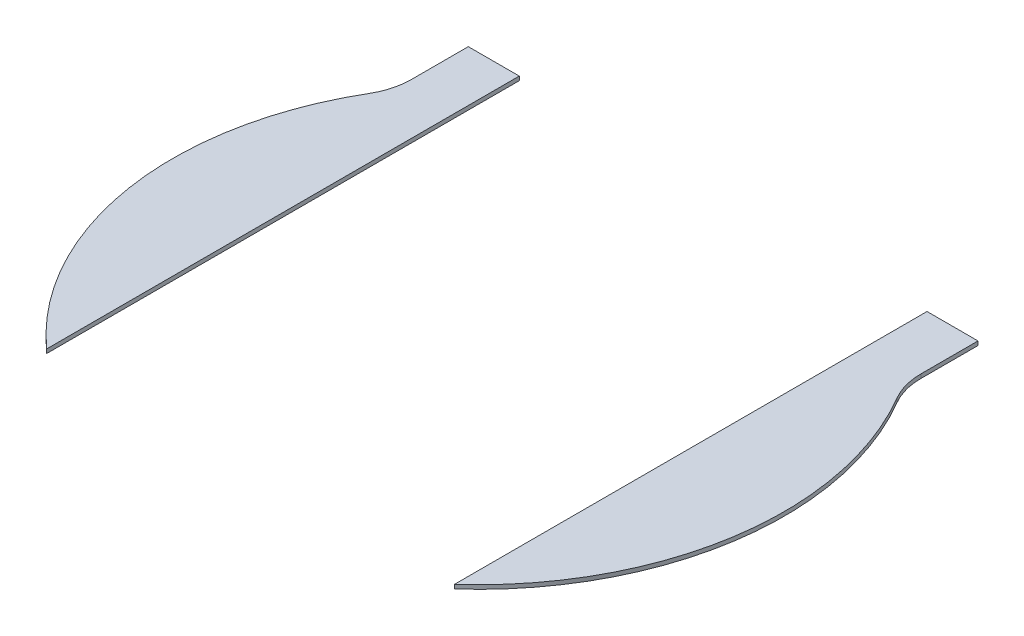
ISO-10303-21;
HEADER;
FILE_DESCRIPTION(('STEP AP214'),'2;1');
FILE_NAME('part.step','',(''),(''),'','','');
FILE_SCHEMA(('AUTOMOTIVE_DESIGN { 1 0 10303 214 1 1 1 1 }'));
ENDSEC;
DATA;
#1=APPLICATION_CONTEXT('core data for automotive mechanical design processes');
#2=APPLICATION_PROTOCOL_DEFINITION('international standard','automotive_design',2000,#1);
#3=PRODUCT_CONTEXT('',#1,'mechanical');
#4=PRODUCT('Part','Part','',(#3));
#5=PRODUCT_RELATED_PRODUCT_CATEGORY('part','',(#4));
#6=PRODUCT_DEFINITION_FORMATION('','',#4);
#7=PRODUCT_DEFINITION_CONTEXT('part definition',#1,'design');
#8=PRODUCT_DEFINITION('design','',#6,#7);
#9=PRODUCT_DEFINITION_SHAPE('','',#8);
#10=(LENGTH_UNIT() NAMED_UNIT(*) SI_UNIT(.MILLI.,.METRE.));
#11=(NAMED_UNIT(*) PLANE_ANGLE_UNIT() SI_UNIT($,.RADIAN.));
#12=(NAMED_UNIT(*) SI_UNIT($,.STERADIAN.) SOLID_ANGLE_UNIT());
#13=UNCERTAINTY_MEASURE_WITH_UNIT(LENGTH_MEASURE(1.E-05),#10,'distance_accuracy_value','');
#14=(GEOMETRIC_REPRESENTATION_CONTEXT(3) GLOBAL_UNCERTAINTY_ASSIGNED_CONTEXT((#13)) GLOBAL_UNIT_ASSIGNED_CONTEXT((#10,
#11,#12)) REPRESENTATION_CONTEXT('',''));
#15=CARTESIAN_POINT('',(0.,0.,0.));
#16=DIRECTION('',(0.,0.,1.));
#17=DIRECTION('',(1.,0.,0.));
#18=AXIS2_PLACEMENT_3D('',#15,#16,#17);
#19=CARTESIAN_POINT('',(3.98779999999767,0.05,-2.33831798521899));
#20=DIRECTION('',(0.,-1.,0.));
#21=DIRECTION('',(0.,0.,-1.));
#22=AXIS2_PLACEMENT_3D('',#19,#20,#21);
#23=CYLINDRICAL_SURFACE('',#22,0.812799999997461);
#24=CARTESIAN_POINT('',(3.98779999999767,0.,-2.33831798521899));
#25=DIRECTION('',(0.,1.,0.));
#26=DIRECTION('',(0.,0.,1.));
#27=AXIS2_PLACEMENT_3D('',#24,#25,#26);
#28=CIRCLE('',#27,0.812799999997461);
#29=CARTESIAN_POINT('',(3.17500000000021,0.,-2.33831798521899));
#30=VERTEX_POINT('',#29);
#31=CARTESIAN_POINT('',(3.28664835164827,0.,-1.92718515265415));
#32=VERTEX_POINT('',#31);
#33=EDGE_CURVE('E114',#30,#32,#28,.T.);
#34=ORIENTED_EDGE('',*,*,#33,.F.);
#35=DIRECTION('',(0.,-1.,0.));
#36=VECTOR('',#35,1.);
#37=CARTESIAN_POINT('',(3.17500000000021,0.05,-2.33831798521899));
#38=LINE('',#37,#36);
#39=CARTESIAN_POINT('',(3.17500000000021,0.05,-2.33831798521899));
#40=VERTEX_POINT('',#39);
#41=EDGE_CURVE('E12',#40,#30,#38,.T.);
#42=ORIENTED_EDGE('',*,*,#41,.F.);
#43=CARTESIAN_POINT('',(3.98779999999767,0.05,-2.33831798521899));
#44=DIRECTION('',(0.,1.,0.));
#45=DIRECTION('',(0.,0.,1.));
#46=AXIS2_PLACEMENT_3D('',#43,#44,#45);
#47=CIRCLE('',#46,0.812799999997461);
#48=CARTESIAN_POINT('',(3.28664835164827,0.05,-1.92718515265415));
#49=VERTEX_POINT('',#48);
#50=EDGE_CURVE('E124',#40,#49,#47,.T.);
#51=ORIENTED_EDGE('',*,*,#50,.T.);
#52=DIRECTION('',(0.,-1.,0.));
#53=VECTOR('',#52,1.);
#54=CARTESIAN_POINT('',(3.28664835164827,0.05,-1.92718515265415));
#55=LINE('',#54,#53);
#56=EDGE_CURVE('E81',#49,#32,#55,.T.);
#57=ORIENTED_EDGE('',*,*,#56,.T.);
#58=EDGE_LOOP('',(#34,#42,#51,#57));
#59=FACE_BOUND('',#58,.T.);
#60=ADVANCED_FACE('F40',(#59),#23,.F.);
#61=CARTESIAN_POINT('',(3.17500000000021,0.05,-0.104096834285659));
#62=DIRECTION('',(-1.,0.,0.));
#63=DIRECTION('',(0.,0.,1.));
#64=AXIS2_PLACEMENT_3D('',#61,#62,#63);
#65=PLANE('',#64);
#66=DIRECTION('',(0.,0.,-1.));
#67=VECTOR('',#66,1.);
#68=CARTESIAN_POINT('',(3.17500000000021,0.,-0.104096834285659));
#69=LINE('',#68,#67);
#70=CARTESIAN_POINT('',(3.17500000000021,0.,-3.04800000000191));
#71=VERTEX_POINT('',#70);
#72=EDGE_CURVE('E117',#30,#71,#69,.T.);
#73=ORIENTED_EDGE('',*,*,#72,.T.);
#74=DIRECTION('',(0.,-1.,0.));
#75=VECTOR('',#74,1.);
#76=CARTESIAN_POINT('',(3.17500000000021,0.05,-3.04800000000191));
#77=LINE('',#76,#75);
#78=CARTESIAN_POINT('',(3.17500000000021,0.05,-3.04800000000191));
#79=VERTEX_POINT('',#78);
#80=EDGE_CURVE('E48',#79,#71,#77,.T.);
#81=ORIENTED_EDGE('',*,*,#80,.F.);
#82=DIRECTION('',(0.,0.,-1.));
#83=VECTOR('',#82,1.);
#84=CARTESIAN_POINT('',(3.17500000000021,0.05,-0.104096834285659));
#85=LINE('',#84,#83);
#86=EDGE_CURVE('E95',#40,#79,#85,.T.);
#87=ORIENTED_EDGE('',*,*,#86,.F.);
#88=ORIENTED_EDGE('',*,*,#41,.T.);
#89=EDGE_LOOP('',(#73,#81,#87,#88));
#90=FACE_BOUND('',#89,.T.);
#91=ADVANCED_FACE('F133',(#90),#65,.F.);
#92=CARTESIAN_POINT('',(-7.63155161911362,0.05,-3.04800000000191));
#93=DIRECTION('',(0.,0.,1.));
#94=DIRECTION('',(1.,0.,0.));
#95=AXIS2_PLACEMENT_3D('',#92,#93,#94);
#96=PLANE('',#95);
#97=DIRECTION('',(-1.,0.,0.));
#98=VECTOR('',#97,1.);
#99=CARTESIAN_POINT('',(-7.63155161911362,0.,-3.04800000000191));
#100=LINE('',#99,#98);
#101=CARTESIAN_POINT('',(2.54000000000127,0.,-3.04800000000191));
#102=VERTEX_POINT('',#101);
#103=EDGE_CURVE('E104',#71,#102,#100,.T.);
#104=ORIENTED_EDGE('',*,*,#103,.T.);
#105=DIRECTION('',(0.,-1.,0.));
#106=VECTOR('',#105,1.);
#107=CARTESIAN_POINT('',(2.54000000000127,0.05,-3.04800000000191));
#108=LINE('',#107,#106);
#109=CARTESIAN_POINT('',(2.54000000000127,0.05,-3.04800000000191));
#110=VERTEX_POINT('',#109);
#111=EDGE_CURVE('E101',#110,#102,#108,.T.);
#112=ORIENTED_EDGE('',*,*,#111,.F.);
#113=DIRECTION('',(-1.,0.,0.));
#114=VECTOR('',#113,1.);
#115=CARTESIAN_POINT('',(-7.63155161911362,0.05,-3.04800000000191));
#116=LINE('',#115,#114);
#117=EDGE_CURVE('E90',#79,#110,#116,.T.);
#118=ORIENTED_EDGE('',*,*,#117,.F.);
#119=ORIENTED_EDGE('',*,*,#80,.T.);
#120=EDGE_LOOP('',(#104,#112,#118,#119));
#121=FACE_BOUND('',#120,.T.);
#122=ADVANCED_FACE('F102',(#121),#96,.F.);
#123=CARTESIAN_POINT('',(2.54000000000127,0.05,-0.104096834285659));
#124=DIRECTION('',(-1.,0.,0.));
#125=DIRECTION('',(0.,0.,1.));
#126=AXIS2_PLACEMENT_3D('',#123,#124,#125);
#127=PLANE('',#126);
#128=DIRECTION('',(0.,0.,-1.));
#129=VECTOR('',#128,1.);
#130=CARTESIAN_POINT('',(2.54000000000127,0.,-0.104096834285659));
#131=LINE('',#130,#129);
#132=CARTESIAN_POINT('',(2.54000000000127,0.,2.83980633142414));
#133=VERTEX_POINT('',#132);
#134=EDGE_CURVE('E120',#133,#102,#131,.T.);
#135=ORIENTED_EDGE('',*,*,#134,.F.);
#136=DIRECTION('',(0.,-1.,0.));
#137=VECTOR('',#136,1.);
#138=CARTESIAN_POINT('',(2.54000000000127,0.05,2.83980633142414));
#139=LINE('',#138,#137);
#140=CARTESIAN_POINT('',(2.54000000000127,0.05,2.83980633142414));
#141=VERTEX_POINT('',#140);
#142=EDGE_CURVE('E74',#141,#133,#139,.T.);
#143=ORIENTED_EDGE('',*,*,#142,.F.);
#144=DIRECTION('',(0.,0.,-1.));
#145=VECTOR('',#144,1.);
#146=CARTESIAN_POINT('',(2.54000000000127,0.05,-0.104096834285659));
#147=LINE('',#146,#145);
#148=EDGE_CURVE('E94',#141,#110,#147,.T.);
#149=ORIENTED_EDGE('',*,*,#148,.T.);
#150=ORIENTED_EDGE('',*,*,#111,.T.);
#151=EDGE_LOOP('',(#135,#143,#149,#150));
#152=FACE_BOUND('',#151,.T.);
#153=ADVANCED_FACE('F109',(#152),#127,.T.);
#154=CARTESIAN_POINT('',(2.21177243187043E-13,0.05,0.));
#155=DIRECTION('',(0.,-1.,0.));
#156=DIRECTION('',(0.,0.,-1.));
#157=AXIS2_PLACEMENT_3D('',#154,#155,#156);
#158=CYLINDRICAL_SURFACE('',#157,3.81000000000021);
#159=CARTESIAN_POINT('',(2.21177243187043E-13,0.,0.));
#160=DIRECTION('',(0.,1.,0.));
#161=DIRECTION('',(0.,0.,1.));
#162=AXIS2_PLACEMENT_3D('',#159,#160,#161);
#163=CIRCLE('',#162,3.81000000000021);
#164=EDGE_CURVE('E122',#133,#32,#163,.T.);
#165=ORIENTED_EDGE('',*,*,#164,.T.);
#166=ORIENTED_EDGE('',*,*,#56,.F.);
#167=CARTESIAN_POINT('',(2.21177243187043E-13,0.05,0.));
#168=DIRECTION('',(0.,1.,0.));
#169=DIRECTION('',(0.,0.,1.));
#170=AXIS2_PLACEMENT_3D('',#167,#168,#169);
#171=CIRCLE('',#170,3.81000000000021);
#172=EDGE_CURVE('E56',#141,#49,#171,.T.);
#173=ORIENTED_EDGE('',*,*,#172,.F.);
#174=ORIENTED_EDGE('',*,*,#142,.T.);
#175=EDGE_LOOP('',(#165,#166,#173,#174));
#176=FACE_BOUND('',#175,.T.);
#177=ADVANCED_FACE('F130',(#176),#158,.T.);
#178=CARTESIAN_POINT('',(-7.63155161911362,0.05,-0.104096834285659));
#179=DIRECTION('',(0.,1.,0.));
#180=DIRECTION('',(0.,0.,1.));
#181=AXIS2_PLACEMENT_3D('',#178,#179,#180);
#182=PLANE('',#181);
#183=ORIENTED_EDGE('',*,*,#50,.F.);
#184=ORIENTED_EDGE('',*,*,#86,.T.);
#185=ORIENTED_EDGE('',*,*,#117,.T.);
#186=ORIENTED_EDGE('',*,*,#148,.F.);
#187=ORIENTED_EDGE('',*,*,#172,.T.);
#188=EDGE_LOOP('',(#183,#184,#185,#186,#187));
#189=FACE_BOUND('',#188,.T.);
#190=ADVANCED_FACE('F92',(#189),#182,.T.);
#191=CARTESIAN_POINT('',(-7.63155161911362,0.,-0.104096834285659));
#192=DIRECTION('',(0.,1.,0.));
#193=DIRECTION('',(0.,0.,1.));
#194=AXIS2_PLACEMENT_3D('',#191,#192,#193);
#195=PLANE('',#194);
#196=ORIENTED_EDGE('',*,*,#33,.T.);
#197=ORIENTED_EDGE('',*,*,#164,.F.);
#198=ORIENTED_EDGE('',*,*,#134,.T.);
#199=ORIENTED_EDGE('',*,*,#103,.F.);
#200=ORIENTED_EDGE('',*,*,#72,.F.);
#201=EDGE_LOOP('',(#196,#197,#198,#199,#200));
#202=FACE_BOUND('',#201,.T.);
#203=ADVANCED_FACE('F129',(#202),#195,.F.);
#204=CLOSED_SHELL('',(#60,#91,#122,#153,#177,#190,#203));
#205=MANIFOLD_SOLID_BREP('B2',#204);
#206=CARTESIAN_POINT('',(-3.98779999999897,0.05,-2.33831798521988));
#207=DIRECTION('',(0.,-1.,0.));
#208=DIRECTION('',(0.,0.,-1.));
#209=AXIS2_PLACEMENT_3D('',#206,#207,#208);
#210=CYLINDRICAL_SURFACE('',#209,0.812799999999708);
#211=CARTESIAN_POINT('',(-3.98779999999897,0.,-2.33831798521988));
#212=DIRECTION('',(0.,1.,0.));
#213=DIRECTION('',(0.,0.,1.));
#214=AXIS2_PLACEMENT_3D('',#211,#212,#213);
#215=CIRCLE('',#214,0.812799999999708);
#216=CARTESIAN_POINT('',(-3.28664835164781,0.,-1.9271851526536));
#217=VERTEX_POINT('',#216);
#218=CARTESIAN_POINT('',(-3.17499999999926,0.,-2.33831798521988));
#219=VERTEX_POINT('',#218);
#220=EDGE_CURVE('E263',#217,#219,#215,.T.);
#221=ORIENTED_EDGE('',*,*,#220,.F.);
#222=DIRECTION('',(0.,-1.,0.));
#223=VECTOR('',#222,1.);
#224=CARTESIAN_POINT('',(-3.28664835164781,0.05,-1.9271851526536));
#225=LINE('',#224,#223);
#226=CARTESIAN_POINT('',(-3.28664835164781,0.05,-1.9271851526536));
#227=VERTEX_POINT('',#226);
#228=EDGE_CURVE('E38',#227,#217,#225,.T.);
#229=ORIENTED_EDGE('',*,*,#228,.F.);
#230=CARTESIAN_POINT('',(-3.98779999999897,0.05,-2.33831798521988));
#231=DIRECTION('',(0.,1.,0.));
#232=DIRECTION('',(0.,0.,1.));
#233=AXIS2_PLACEMENT_3D('',#230,#231,#232);
#234=CIRCLE('',#233,0.812799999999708);
#235=CARTESIAN_POINT('',(-3.17499999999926,0.05,-2.33831798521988));
#236=VERTEX_POINT('',#235);
#237=EDGE_CURVE('E273',#227,#236,#234,.T.);
#238=ORIENTED_EDGE('',*,*,#237,.T.);
#239=DIRECTION('',(0.,-1.,0.));
#240=VECTOR('',#239,1.);
#241=CARTESIAN_POINT('',(-3.17499999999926,0.05,-2.33831798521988));
#242=LINE('',#241,#240);
#243=EDGE_CURVE('E205',#236,#219,#242,.T.);
#244=ORIENTED_EDGE('',*,*,#243,.T.);
#245=EDGE_LOOP('',(#221,#229,#238,#244));
#246=FACE_BOUND('',#245,.T.);
#247=ADVANCED_FACE('F189',(#246),#210,.F.);
#248=CARTESIAN_POINT('',(2.21177243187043E-13,0.05,0.));
#249=DIRECTION('',(0.,-1.,0.));
#250=DIRECTION('',(0.,0.,-1.));
#251=AXIS2_PLACEMENT_3D('',#248,#249,#250);
#252=CYLINDRICAL_SURFACE('',#251,3.80999999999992);
#253=CARTESIAN_POINT('',(2.21177243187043E-13,0.,0.));
#254=DIRECTION('',(0.,1.,0.));
#255=DIRECTION('',(0.,0.,1.));
#256=AXIS2_PLACEMENT_3D('',#253,#254,#255);
#257=CIRCLE('',#256,3.80999999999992);
#258=CARTESIAN_POINT('',(-2.5399999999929,0.,2.83980633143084));
#259=VERTEX_POINT('',#258);
#260=EDGE_CURVE('E265',#217,#259,#257,.T.);
#261=ORIENTED_EDGE('',*,*,#260,.T.);
#262=DIRECTION('',(0.,-1.,0.));
#263=VECTOR('',#262,1.);
#264=CARTESIAN_POINT('',(-2.5399999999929,0.05,2.83980633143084));
#265=LINE('',#264,#263);
#266=CARTESIAN_POINT('',(-2.5399999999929,0.05,2.83980633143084));
#267=VERTEX_POINT('',#266);
#268=EDGE_CURVE('E197',#267,#259,#265,.T.);
#269=ORIENTED_EDGE('',*,*,#268,.F.);
#270=CARTESIAN_POINT('',(2.21177243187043E-13,0.05,0.));
#271=DIRECTION('',(0.,1.,0.));
#272=DIRECTION('',(0.,0.,1.));
#273=AXIS2_PLACEMENT_3D('',#270,#271,#272);
#274=CIRCLE('',#273,3.80999999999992);
#275=EDGE_CURVE('E244',#227,#267,#274,.T.);
#276=ORIENTED_EDGE('',*,*,#275,.F.);
#277=ORIENTED_EDGE('',*,*,#228,.T.);
#278=EDGE_LOOP('',(#261,#269,#276,#277));
#279=FACE_BOUND('',#278,.T.);
#280=ADVANCED_FACE('F290',(#279),#252,.T.);
#281=CARTESIAN_POINT('',(-2.5399999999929,0.05,-0.104096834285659));
#282=DIRECTION('',(-1.,0.,0.));
#283=DIRECTION('',(0.,0.,1.));
#284=AXIS2_PLACEMENT_3D('',#281,#282,#283);
#285=PLANE('',#284);
#286=DIRECTION('',(0.,0.,-1.));
#287=VECTOR('',#286,1.);
#288=CARTESIAN_POINT('',(-2.5399999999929,0.,-0.104096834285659));
#289=LINE('',#288,#287);
#290=CARTESIAN_POINT('',(-2.5399999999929,0.,-3.04800000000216));
#291=VERTEX_POINT('',#290);
#292=EDGE_CURVE('E253',#259,#291,#289,.T.);
#293=ORIENTED_EDGE('',*,*,#292,.T.);
#294=DIRECTION('',(0.,-1.,0.));
#295=VECTOR('',#294,1.);
#296=CARTESIAN_POINT('',(-2.5399999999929,0.05,-3.04800000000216));
#297=LINE('',#296,#295);
#298=CARTESIAN_POINT('',(-2.5399999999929,0.05,-3.04800000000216));
#299=VERTEX_POINT('',#298);
#300=EDGE_CURVE('E250',#299,#291,#297,.T.);
#301=ORIENTED_EDGE('',*,*,#300,.F.);
#302=DIRECTION('',(0.,0.,-1.));
#303=VECTOR('',#302,1.);
#304=CARTESIAN_POINT('',(-2.5399999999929,0.05,-0.104096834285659));
#305=LINE('',#304,#303);
#306=EDGE_CURVE('E237',#267,#299,#305,.T.);
#307=ORIENTED_EDGE('',*,*,#306,.F.);
#308=ORIENTED_EDGE('',*,*,#268,.T.);
#309=EDGE_LOOP('',(#293,#301,#307,#308));
#310=FACE_BOUND('',#309,.T.);
#311=ADVANCED_FACE('F251',(#310),#285,.F.);
#312=CARTESIAN_POINT('',(-7.63155161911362,0.05,-3.04800000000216));
#313=DIRECTION('',(0.,0.,1.));
#314=DIRECTION('',(1.,0.,0.));
#315=AXIS2_PLACEMENT_3D('',#312,#313,#314);
#316=PLANE('',#315);
#317=DIRECTION('',(-1.,0.,0.));
#318=VECTOR('',#317,1.);
#319=CARTESIAN_POINT('',(-7.63155161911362,0.,-3.04800000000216));
#320=LINE('',#319,#318);
#321=CARTESIAN_POINT('',(-3.17499999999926,0.,-3.04800000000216));
#322=VERTEX_POINT('',#321);
#323=EDGE_CURVE('E268',#291,#322,#320,.T.);
#324=ORIENTED_EDGE('',*,*,#323,.T.);
#325=DIRECTION('',(0.,-1.,0.));
#326=VECTOR('',#325,1.);
#327=CARTESIAN_POINT('',(-3.17499999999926,0.05,-3.04800000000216));
#328=LINE('',#327,#326);
#329=CARTESIAN_POINT('',(-3.17499999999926,0.05,-3.04800000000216));
#330=VERTEX_POINT('',#329);
#331=EDGE_CURVE('E222',#330,#322,#328,.T.);
#332=ORIENTED_EDGE('',*,*,#331,.F.);
#333=DIRECTION('',(-1.,0.,0.));
#334=VECTOR('',#333,1.);
#335=CARTESIAN_POINT('',(-7.63155161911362,0.05,-3.04800000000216));
#336=LINE('',#335,#334);
#337=EDGE_CURVE('E243',#299,#330,#336,.T.);
#338=ORIENTED_EDGE('',*,*,#337,.F.);
#339=ORIENTED_EDGE('',*,*,#300,.T.);
#340=EDGE_LOOP('',(#324,#332,#338,#339));
#341=FACE_BOUND('',#340,.T.);
#342=ADVANCED_FACE('F257',(#341),#316,.F.);
#343=CARTESIAN_POINT('',(-3.17499999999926,0.05,-0.104096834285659));
#344=DIRECTION('',(-1.,0.,0.));
#345=DIRECTION('',(0.,0.,1.));
#346=AXIS2_PLACEMENT_3D('',#343,#344,#345);
#347=PLANE('',#346);
#348=DIRECTION('',(0.,0.,-1.));
#349=VECTOR('',#348,1.);
#350=CARTESIAN_POINT('',(-3.17499999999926,0.,-0.104096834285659));
#351=LINE('',#350,#349);
#352=EDGE_CURVE('E270',#219,#322,#351,.T.);
#353=ORIENTED_EDGE('',*,*,#352,.F.);
#354=ORIENTED_EDGE('',*,*,#243,.F.);
#355=DIRECTION('',(0.,0.,-1.));
#356=VECTOR('',#355,1.);
#357=CARTESIAN_POINT('',(-3.17499999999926,0.05,-0.104096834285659));
#358=LINE('',#357,#356);
#359=EDGE_CURVE('E258',#236,#330,#358,.T.);
#360=ORIENTED_EDGE('',*,*,#359,.T.);
#361=ORIENTED_EDGE('',*,*,#331,.T.);
#362=EDGE_LOOP('',(#353,#354,#360,#361));
#363=FACE_BOUND('',#362,.T.);
#364=ADVANCED_FACE('F279',(#363),#347,.T.);
#365=CARTESIAN_POINT('',(-7.63155161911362,0.05,-0.104096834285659));
#366=DIRECTION('',(0.,1.,0.));
#367=DIRECTION('',(0.,0.,1.));
#368=AXIS2_PLACEMENT_3D('',#365,#366,#367);
#369=PLANE('',#368);
#370=ORIENTED_EDGE('',*,*,#237,.F.);
#371=ORIENTED_EDGE('',*,*,#275,.T.);
#372=ORIENTED_EDGE('',*,*,#306,.T.);
#373=ORIENTED_EDGE('',*,*,#337,.T.);
#374=ORIENTED_EDGE('',*,*,#359,.F.);
#375=EDGE_LOOP('',(#370,#371,#372,#373,#374));
#376=FACE_BOUND('',#375,.T.);
#377=ADVANCED_FACE('F240',(#376),#369,.T.);
#378=CARTESIAN_POINT('',(-7.63155161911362,0.,-0.104096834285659));
#379=DIRECTION('',(0.,1.,0.));
#380=DIRECTION('',(0.,0.,1.));
#381=AXIS2_PLACEMENT_3D('',#378,#379,#380);
#382=PLANE('',#381);
#383=ORIENTED_EDGE('',*,*,#220,.T.);
#384=ORIENTED_EDGE('',*,*,#352,.T.);
#385=ORIENTED_EDGE('',*,*,#323,.F.);
#386=ORIENTED_EDGE('',*,*,#292,.F.);
#387=ORIENTED_EDGE('',*,*,#260,.F.);
#388=EDGE_LOOP('',(#383,#384,#385,#386,#387));
#389=FACE_BOUND('',#388,.T.);
#390=ADVANCED_FACE('F278',(#389),#382,.F.);
#391=CLOSED_SHELL('',(#247,#280,#311,#342,#364,#377,#390));
#392=MANIFOLD_SOLID_BREP('B6',#391);
#393=ADVANCED_BREP_SHAPE_REPRESENTATION('',(#18,#205,#392),#14);
#394=SHAPE_DEFINITION_REPRESENTATION(#9,#393);
ENDSEC;
END-ISO-10303-21;
